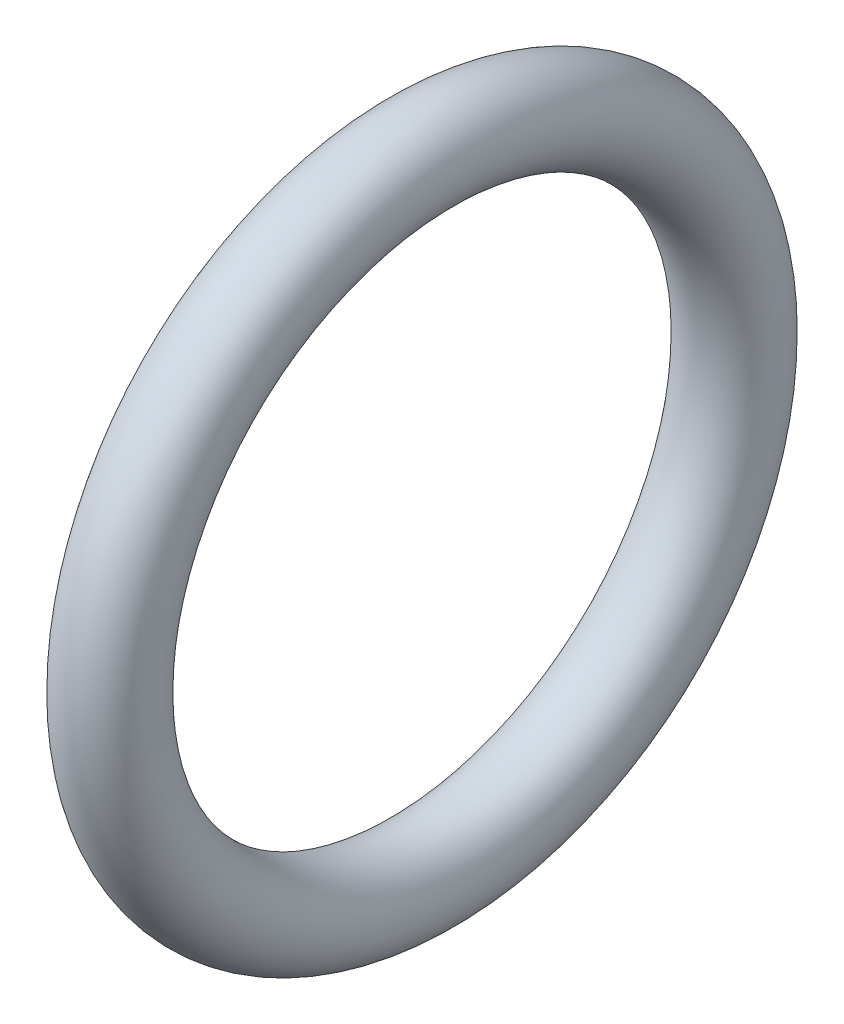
from build123d import *

# Parameters (mm, degrees)
ESQUISSE2_R = 0.5


with BuildPart() as part:
    # Esquisse2 → Base-R_volution (revolve)
    with BuildSketch(Plane.XY, mode=Mode.PRIVATE) as base_r_volution_sk:
        with Locations((0.5, 3.5)):
            Circle(ESQUISSE2_R)
    revolve(base_r_volution_sk.sketch.rotate(Axis((0, 0, 0), (1, 0, 0)), 90), axis=Axis((0, 0, 0), (1, 0, 0)))


solid = part.part
